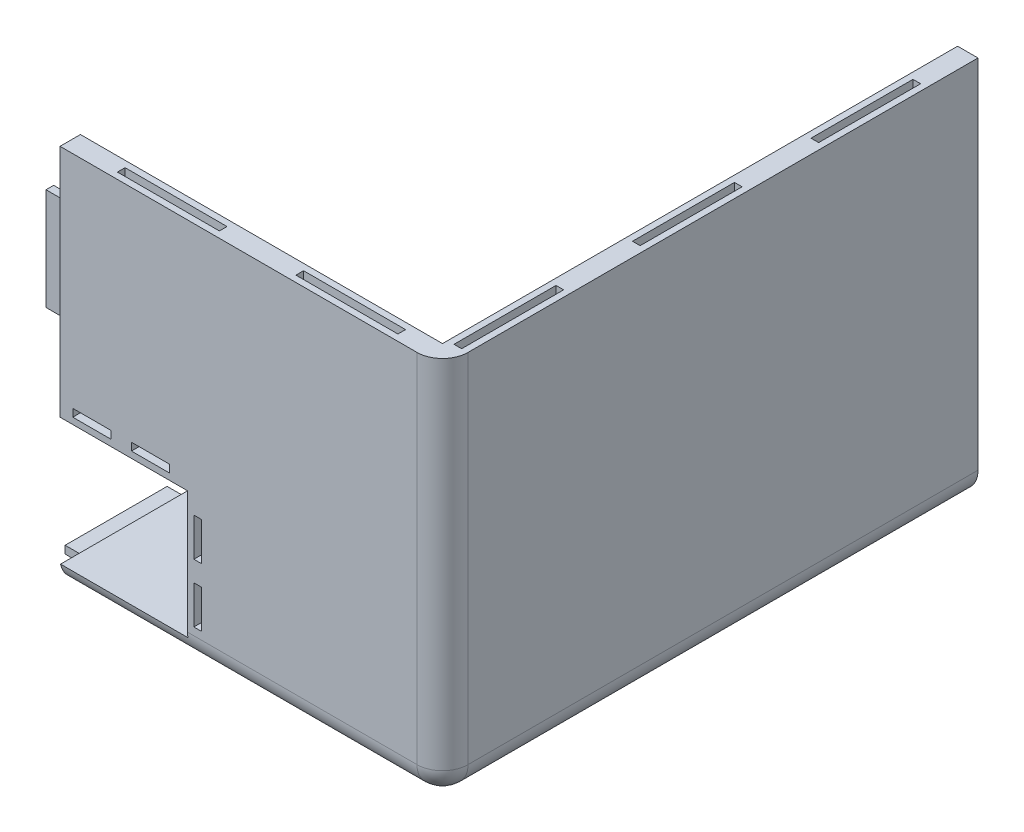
from build123d import *

# Parameters (mm, degrees)
CROQUIS1_W              = 150
CROQUIS1_H              = 210
SALIENTE_EXTRUIR1_DEPTH = 150
CROQUIS2_W              = 142
CROQUIS2_H              = 202
CORTAR_EXTRUIR1_DEPTH   = 142
CROQUIS5_W              = 40
CROQUIS5_H              = 3
CROQUIS5_W_2            = 3
CROQUIS5_H_2            = 40
SALIENTE_EXTRUIR3_DEPTH = 8
CROQUIS6_W              = 3
CROQUIS6_H              = 40
CROQUIS6_W_2            = 40
CROQUIS6_H_2            = 3
CORTAR_EXTRUIR2_DEPTH   = 8
REDONDEO1_R             = 10
CROQUIS3_W              = 40
CROQUIS3_H              = 3
CROQUIS3_W_2            = 3
CROQUIS3_H_2            = 40
CORTAR_EXTRUIR3_DEPTH   = 10
CROQUIS7_W              = 88
CROQUIS7_H              = 130
CORTAR_EXTRUIR4_DEPTH   = 10
CROQUIS8_W              = 50
CROQUIS8_H              = 50
CORTAR_EXTRUIR5_DEPTH   = 10
CROQUIS9_W              = 15
CROQUIS9_H              = 3
CROQUIS9_W_2            = 3
CROQUIS9_H_2            = 15
CORTAR_EXTRUIR6_DEPTH   = 6


with BuildPart() as part:
    # Croquis1 → Saliente-Extruir1 (new body)
    with BuildSketch(Plane(origin=(0, 0, 0), x_dir=(1, 0, 0), z_dir=(0, 1, 0))):
        with Locations((75, 105)):
            Rectangle(CROQUIS1_W, CROQUIS1_H)
    extrude(amount=SALIENTE_EXTRUIR1_DEPTH)

    # Croquis2 → Cortar-Extruir1 (cut)
    with BuildSketch(Plane(origin=(0, 150, 0), x_dir=(1, 0, 0), z_dir=(0, 1, 0))):
        with Locations((71, 109)):
            Rectangle(CROQUIS2_W, CROQUIS2_H)
    extrude(amount=-CORTAR_EXTRUIR1_DEPTH, mode=Mode.SUBTRACT)

    # Croquis5 → Saliente-Extruir3 (add)
    with BuildSketch(Plane.ZY):
        with Locations((-170, 4)):
            Rectangle(CROQUIS5_W, CROQUIS5_H)
        with Locations((-100, 4)):
            Rectangle(CROQUIS5_W, CROQUIS5_H)
        with Locations((-30, 4)):
            Rectangle(CROQUIS5_W, CROQUIS5_H)
        with Locations((-4, 110)):
            Rectangle(CROQUIS5_W_2, CROQUIS5_H_2)
    extrude(amount=SALIENTE_EXTRUIR3_DEPTH)

    # Croquis6 → Cortar-Extruir2 (cut)
    with BuildSketch(Plane(origin=(0, 0, -210), x_dir=(-1, 0, 0), z_dir=(0, 0, -1))):
        with Locations((-146, 110)):
            Rectangle(CROQUIS6_W, CROQUIS6_H)
        with Locations((-146, 40)):
            Rectangle(CROQUIS6_W, CROQUIS6_H)
        with Locations((-110, 4)):
            Rectangle(CROQUIS6_W_2, CROQUIS6_H_2)
        with Locations((-40, 4)):
            Rectangle(CROQUIS6_W_2, CROQUIS6_H_2)
    extrude(amount=-CORTAR_EXTRUIR2_DEPTH, mode=Mode.SUBTRACT)

    # Redondeo1
    redondeo1_edges = [part.edges().sort_by_distance(p)[0] for p in [
        (150, 0, -105),
        (75, 0, 0),
        (150, 75, 0),
    ]]
    fillet(redondeo1_edges, radius=REDONDEO1_R)

    # Croquis3 → Cortar-Extruir3 (cut)
    with BuildSketch(Plane(origin=(0, 150, 0), x_dir=(1, 0, 0), z_dir=(0, 1, 0))):
        with Locations((40, 4)):
            Rectangle(CROQUIS3_W, CROQUIS3_H)
        with Locations((110, 4)):
            Rectangle(CROQUIS3_W, CROQUIS3_H)
        with Locations((146, 170)):
            Rectangle(CROQUIS3_W_2, CROQUIS3_H_2)
        with Locations((146, 100)):
            Rectangle(CROQUIS3_W_2, CROQUIS3_H_2)
        with Locations((146, 30)):
            Rectangle(CROQUIS3_W_2, CROQUIS3_H_2)
    extrude(amount=-CORTAR_EXTRUIR3_DEPTH, mode=Mode.SUBTRACT)

    # Croquis7 → Cortar-Extruir4 (cut)
    with BuildSketch(Plane.XZ):
        with Locations((36, -145)):
            Rectangle(CROQUIS7_W, CROQUIS7_H)
    extrude(amount=-CORTAR_EXTRUIR4_DEPTH, mode=Mode.SUBTRACT)

    # Croquis8 → Cortar-Extruir5 (cut)
    with BuildSketch(Plane.XY):
        with Locations((25, 33)):
            Rectangle(CROQUIS8_W, CROQUIS8_H)
    extrude(amount=-CORTAR_EXTRUIR5_DEPTH, mode=Mode.SUBTRACT)

    # Croquis9 → Cortar-Extruir6 (cut)
    with BuildSketch(Plane.XY):
        with Locations((12.5, 62)):
            Rectangle(CROQUIS9_W, CROQUIS9_H)
        with Locations((35.5, 62)):
            Rectangle(CROQUIS9_W, CROQUIS9_H)
        with Locations((54, 43.5)):
            Rectangle(CROQUIS9_W_2, CROQUIS9_H_2)
        with Locations((54, 20.5)):
            Rectangle(CROQUIS9_W_2, CROQUIS9_H_2)
    extrude(amount=-CORTAR_EXTRUIR6_DEPTH, mode=Mode.SUBTRACT)


solid = part.part
